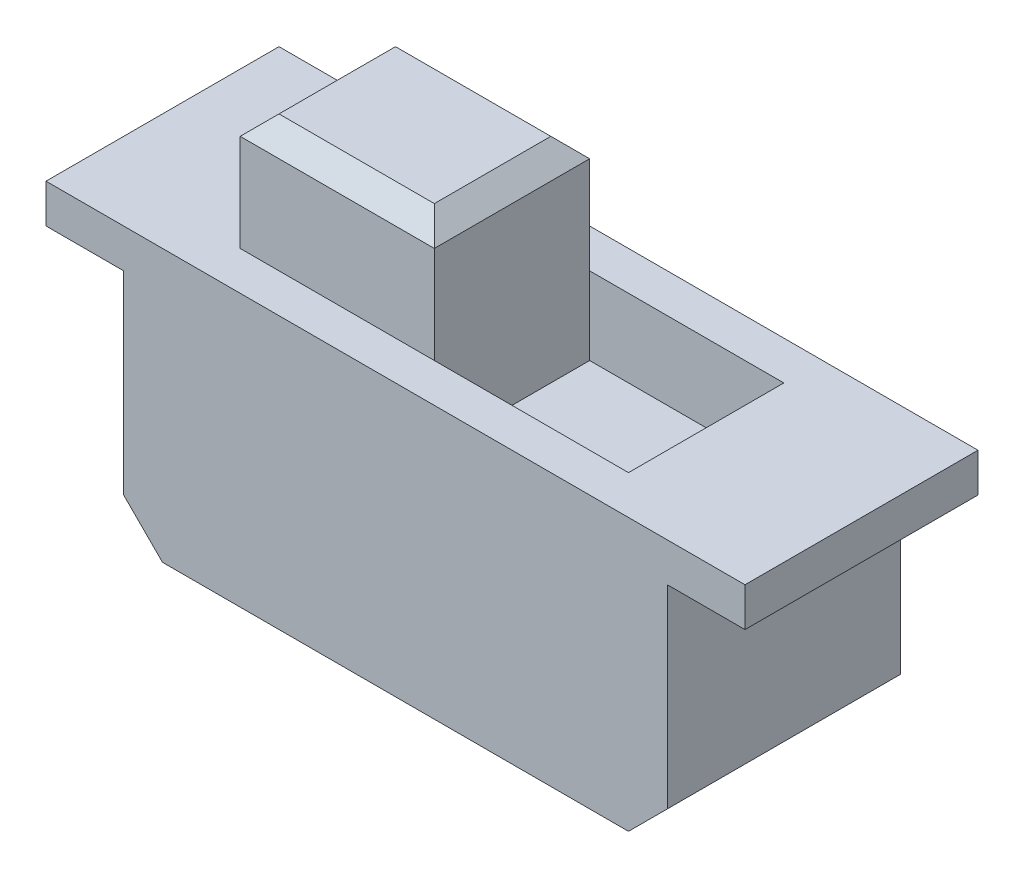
ISO-10303-21;
HEADER;
FILE_DESCRIPTION(('STEP AP214'),'2;1');
FILE_NAME('part.step','',(''),(''),'','','');
FILE_SCHEMA(('AUTOMOTIVE_DESIGN { 1 0 10303 214 1 1 1 1 }'));
ENDSEC;
DATA;
#1=APPLICATION_CONTEXT('core data for automotive mechanical design processes');
#2=APPLICATION_PROTOCOL_DEFINITION('international standard','automotive_design',2000,#1);
#3=PRODUCT_CONTEXT('',#1,'mechanical');
#4=PRODUCT('Part','Part','',(#3));
#5=PRODUCT_RELATED_PRODUCT_CATEGORY('part','',(#4));
#6=PRODUCT_DEFINITION_FORMATION('','',#4);
#7=PRODUCT_DEFINITION_CONTEXT('part definition',#1,'design');
#8=PRODUCT_DEFINITION('design','',#6,#7);
#9=PRODUCT_DEFINITION_SHAPE('','',#8);
#10=(LENGTH_UNIT() NAMED_UNIT(*) SI_UNIT(.MILLI.,.METRE.));
#11=(NAMED_UNIT(*) PLANE_ANGLE_UNIT() SI_UNIT($,.RADIAN.));
#12=(NAMED_UNIT(*) SI_UNIT($,.STERADIAN.) SOLID_ANGLE_UNIT());
#13=UNCERTAINTY_MEASURE_WITH_UNIT(LENGTH_MEASURE(1.E-05),#10,'distance_accuracy_value','');
#14=(GEOMETRIC_REPRESENTATION_CONTEXT(3) GLOBAL_UNCERTAINTY_ASSIGNED_CONTEXT((#13)) GLOBAL_UNIT_ASSIGNED_CONTEXT((#10,
#11,#12)) REPRESENTATION_CONTEXT('',''));
#15=CARTESIAN_POINT('',(0.,0.,0.));
#16=DIRECTION('',(0.,0.,1.));
#17=DIRECTION('',(1.,0.,0.));
#18=AXIS2_PLACEMENT_3D('',#15,#16,#17);
#19=CARTESIAN_POINT('',(-5.,-2.,1.));
#20=DIRECTION('',(0.,0.,-1.));
#21=DIRECTION('',(-1.,0.,0.));
#22=AXIS2_PLACEMENT_3D('',#19,#20,#21);
#23=PLANE('',#22);
#24=DIRECTION('',(0.,-1.,0.));
#25=VECTOR('',#24,1.);
#26=CARTESIAN_POINT('',(0.,3.,0.999999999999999));
#27=LINE('',#26,#25);
#28=CARTESIAN_POINT('',(0.,0.,0.999999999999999));
#29=VERTEX_POINT('',#28);
#30=CARTESIAN_POINT('',(0.,-2.,0.999999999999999));
#31=VERTEX_POINT('',#30);
#32=EDGE_CURVE('E163',#29,#31,#27,.T.);
#33=ORIENTED_EDGE('',*,*,#32,.T.);
#34=DIRECTION('',(-1.,0.,0.));
#35=VECTOR('',#34,1.);
#36=CARTESIAN_POINT('',(-5.,-2.,1.));
#37=LINE('',#36,#35);
#38=CARTESIAN_POINT('',(5.,-2.,0.999999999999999));
#39=VERTEX_POINT('',#38);
#40=EDGE_CURVE('E176',#39,#31,#37,.T.);
#41=ORIENTED_EDGE('',*,*,#40,.F.);
#42=DIRECTION('',(0.,1.,0.));
#43=VECTOR('',#42,1.);
#44=CARTESIAN_POINT('',(5.,-2.,0.999999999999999));
#45=LINE('',#44,#43);
#46=CARTESIAN_POINT('',(5.,0.,0.999999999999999));
#47=VERTEX_POINT('',#46);
#48=EDGE_CURVE('E188',#39,#47,#45,.T.);
#49=ORIENTED_EDGE('',*,*,#48,.T.);
#50=DIRECTION('',(-1.,0.,0.));
#51=VECTOR('',#50,1.);
#52=CARTESIAN_POINT('',(-5.,0.,1.));
#53=LINE('',#52,#51);
#54=EDGE_CURVE('E178',#47,#29,#53,.T.);
#55=ORIENTED_EDGE('',*,*,#54,.T.);
#56=EDGE_LOOP('',(#33,#41,#49,#55));
#57=FACE_BOUND('',#56,.T.);
#58=ADVANCED_FACE('F31',(#57),#23,.F.);
#59=CARTESIAN_POINT('',(-5.,-2.,5.));
#60=DIRECTION('',(0.,0.,1.));
#61=DIRECTION('',(1.,0.,0.));
#62=AXIS2_PLACEMENT_3D('',#59,#60,#61);
#63=PLANE('',#62);
#64=DIRECTION('',(0.,-1.,0.));
#65=VECTOR('',#64,1.);
#66=CARTESIAN_POINT('',(0.,3.,5.));
#67=LINE('',#66,#65);
#68=CARTESIAN_POINT('',(0.,0.,5.));
#69=VERTEX_POINT('',#68);
#70=CARTESIAN_POINT('',(0.,-2.,5.));
#71=VERTEX_POINT('',#70);
#72=EDGE_CURVE('E166',#69,#71,#67,.T.);
#73=ORIENTED_EDGE('',*,*,#72,.F.);
#74=DIRECTION('',(1.,0.,0.));
#75=VECTOR('',#74,1.);
#76=CARTESIAN_POINT('',(-5.,0.,5.));
#77=LINE('',#76,#75);
#78=CARTESIAN_POINT('',(5.,0.,5.));
#79=VERTEX_POINT('',#78);
#80=EDGE_CURVE('E297',#69,#79,#77,.T.);
#81=ORIENTED_EDGE('',*,*,#80,.T.);
#82=DIRECTION('',(0.,1.,0.));
#83=VECTOR('',#82,1.);
#84=CARTESIAN_POINT('',(5.,-2.,5.));
#85=LINE('',#84,#83);
#86=CARTESIAN_POINT('',(5.,-2.,5.));
#87=VERTEX_POINT('',#86);
#88=EDGE_CURVE('E185',#87,#79,#85,.T.);
#89=ORIENTED_EDGE('',*,*,#88,.F.);
#90=DIRECTION('',(1.,0.,0.));
#91=VECTOR('',#90,1.);
#92=CARTESIAN_POINT('',(-5.,-2.,5.));
#93=LINE('',#92,#91);
#94=EDGE_CURVE('E190',#71,#87,#93,.T.);
#95=ORIENTED_EDGE('',*,*,#94,.F.);
#96=EDGE_LOOP('',(#73,#81,#89,#95));
#97=FACE_BOUND('',#96,.T.);
#98=ADVANCED_FACE('F306',(#97),#63,.F.);
#99=CARTESIAN_POINT('',(-5.,-2.,5.));
#100=DIRECTION('',(0.,1.,0.));
#101=DIRECTION('',(0.,0.,1.));
#102=AXIS2_PLACEMENT_3D('',#99,#100,#101);
#103=PLANE('',#102);
#104=ORIENTED_EDGE('',*,*,#40,.T.);
#105=DIRECTION('',(0.,0.,-1.));
#106=VECTOR('',#105,1.);
#107=CARTESIAN_POINT('',(0.,-2.,5.));
#108=LINE('',#107,#106);
#109=EDGE_CURVE('E160',#71,#31,#108,.T.);
#110=ORIENTED_EDGE('',*,*,#109,.F.);
#111=ORIENTED_EDGE('',*,*,#94,.T.);
#112=DIRECTION('',(0.,0.,-1.));
#113=VECTOR('',#112,1.);
#114=CARTESIAN_POINT('',(5.,-2.,0.999999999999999));
#115=LINE('',#114,#113);
#116=EDGE_CURVE('E184',#87,#39,#115,.T.);
#117=ORIENTED_EDGE('',*,*,#116,.T.);
#118=EDGE_LOOP('',(#104,#110,#111,#117));
#119=FACE_BOUND('',#118,.T.);
#120=ADVANCED_FACE('F182',(#119),#103,.T.);
#121=CARTESIAN_POINT('',(-9.,-1.,6.));
#122=DIRECTION('',(1.,0.,0.));
#123=DIRECTION('',(0.,1.,0.));
#124=AXIS2_PLACEMENT_3D('',#121,#122,#123);
#125=PLANE('',#124);
#126=DIRECTION('',(0.,-1.,0.));
#127=VECTOR('',#126,1.);
#128=CARTESIAN_POINT('',(-9.,-1.,0.));
#129=LINE('',#128,#127);
#130=CARTESIAN_POINT('',(-9.,0.,0.));
#131=VERTEX_POINT('',#130);
#132=CARTESIAN_POINT('',(-9.,-1.,0.));
#133=VERTEX_POINT('',#132);
#134=EDGE_CURVE('E194',#131,#133,#129,.T.);
#135=ORIENTED_EDGE('',*,*,#134,.T.);
#136=DIRECTION('',(0.,0.,-1.));
#137=VECTOR('',#136,1.);
#138=CARTESIAN_POINT('',(-9.,-1.,6.));
#139=LINE('',#138,#137);
#140=CARTESIAN_POINT('',(-9.,-1.,6.));
#141=VERTEX_POINT('',#140);
#142=EDGE_CURVE('E264',#141,#133,#139,.T.);
#143=ORIENTED_EDGE('',*,*,#142,.F.);
#144=DIRECTION('',(0.,-1.,0.));
#145=VECTOR('',#144,1.);
#146=CARTESIAN_POINT('',(-9.,-1.,6.));
#147=LINE('',#146,#145);
#148=CARTESIAN_POINT('',(-9.,0.,6.));
#149=VERTEX_POINT('',#148);
#150=EDGE_CURVE('E216',#149,#141,#147,.T.);
#151=ORIENTED_EDGE('',*,*,#150,.F.);
#152=DIRECTION('',(0.,0.,-1.));
#153=VECTOR('',#152,1.);
#154=CARTESIAN_POINT('',(-9.,0.,6.));
#155=LINE('',#154,#153);
#156=EDGE_CURVE('E237',#149,#131,#155,.T.);
#157=ORIENTED_EDGE('',*,*,#156,.T.);
#158=EDGE_LOOP('',(#135,#143,#151,#157));
#159=FACE_BOUND('',#158,.T.);
#160=ADVANCED_FACE('F33',(#159),#125,.F.);
#161=CARTESIAN_POINT('',(-7.,-1.,6.));
#162=DIRECTION('',(0.,1.,0.));
#163=DIRECTION('',(-1.,0.,0.));
#164=AXIS2_PLACEMENT_3D('',#161,#162,#163);
#165=PLANE('',#164);
#166=DIRECTION('',(1.,0.,0.));
#167=VECTOR('',#166,1.);
#168=CARTESIAN_POINT('',(-7.,-1.,0.));
#169=LINE('',#168,#167);
#170=CARTESIAN_POINT('',(-7.,-1.,0.));
#171=VERTEX_POINT('',#170);
#172=EDGE_CURVE('E198',#133,#171,#169,.T.);
#173=ORIENTED_EDGE('',*,*,#172,.T.);
#174=DIRECTION('',(0.,0.,-1.));
#175=VECTOR('',#174,1.);
#176=CARTESIAN_POINT('',(-7.,-1.,6.));
#177=LINE('',#176,#175);
#178=CARTESIAN_POINT('',(-7.,-1.,6.));
#179=VERTEX_POINT('',#178);
#180=EDGE_CURVE('E261',#179,#171,#177,.T.);
#181=ORIENTED_EDGE('',*,*,#180,.F.);
#182=DIRECTION('',(1.,0.,0.));
#183=VECTOR('',#182,1.);
#184=CARTESIAN_POINT('',(-7.,-1.,6.));
#185=LINE('',#184,#183);
#186=EDGE_CURVE('E219',#141,#179,#185,.T.);
#187=ORIENTED_EDGE('',*,*,#186,.F.);
#188=ORIENTED_EDGE('',*,*,#142,.T.);
#189=EDGE_LOOP('',(#173,#181,#187,#188));
#190=FACE_BOUND('',#189,.T.);
#191=ADVANCED_FACE('F397',(#190),#165,.F.);
#192=CARTESIAN_POINT('',(-7.,-6.,6.));
#193=DIRECTION('',(1.,0.,0.));
#194=DIRECTION('',(0.,1.,0.));
#195=AXIS2_PLACEMENT_3D('',#192,#193,#194);
#196=PLANE('',#195);
#197=DIRECTION('',(0.,-1.,0.));
#198=VECTOR('',#197,1.);
#199=CARTESIAN_POINT('',(-7.,-6.,0.));
#200=LINE('',#199,#198);
#201=CARTESIAN_POINT('',(-7.,-6.,0.));
#202=VERTEX_POINT('',#201);
#203=EDGE_CURVE('E200',#171,#202,#200,.T.);
#204=ORIENTED_EDGE('',*,*,#203,.T.);
#205=DIRECTION('',(0.,0.,-1.));
#206=VECTOR('',#205,1.);
#207=CARTESIAN_POINT('',(-7.,-6.,6.));
#208=LINE('',#207,#206);
#209=CARTESIAN_POINT('',(-7.,-6.,6.));
#210=VERTEX_POINT('',#209);
#211=EDGE_CURVE('E258',#210,#202,#208,.T.);
#212=ORIENTED_EDGE('',*,*,#211,.F.);
#213=DIRECTION('',(0.,-1.,0.));
#214=VECTOR('',#213,1.);
#215=CARTESIAN_POINT('',(-7.,-6.,6.));
#216=LINE('',#215,#214);
#217=EDGE_CURVE('E221',#179,#210,#216,.T.);
#218=ORIENTED_EDGE('',*,*,#217,.F.);
#219=ORIENTED_EDGE('',*,*,#180,.T.);
#220=EDGE_LOOP('',(#204,#212,#218,#219));
#221=FACE_BOUND('',#220,.T.);
#222=ADVANCED_FACE('F394',(#221),#196,.F.);
#223=CARTESIAN_POINT('',(-6.,-7.,6.));
#224=DIRECTION('',(0.707106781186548,0.707106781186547,0.));
#225=DIRECTION('',(-0.707106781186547,0.707106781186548,0.));
#226=AXIS2_PLACEMENT_3D('',#223,#224,#225);
#227=PLANE('',#226);
#228=DIRECTION('',(0.707106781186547,-0.707106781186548,0.));
#229=VECTOR('',#228,1.);
#230=CARTESIAN_POINT('',(-6.,-7.,0.));
#231=LINE('',#230,#229);
#232=CARTESIAN_POINT('',(-6.,-7.,0.));
#233=VERTEX_POINT('',#232);
#234=EDGE_CURVE('E202',#202,#233,#231,.T.);
#235=ORIENTED_EDGE('',*,*,#234,.T.);
#236=DIRECTION('',(0.,0.,-1.));
#237=VECTOR('',#236,1.);
#238=CARTESIAN_POINT('',(-6.,-7.,6.));
#239=LINE('',#238,#237);
#240=CARTESIAN_POINT('',(-6.,-7.,6.));
#241=VERTEX_POINT('',#240);
#242=EDGE_CURVE('E255',#241,#233,#239,.T.);
#243=ORIENTED_EDGE('',*,*,#242,.F.);
#244=DIRECTION('',(0.707106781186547,-0.707106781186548,0.));
#245=VECTOR('',#244,1.);
#246=CARTESIAN_POINT('',(-6.,-7.,6.));
#247=LINE('',#246,#245);
#248=EDGE_CURVE('E223',#210,#241,#247,.T.);
#249=ORIENTED_EDGE('',*,*,#248,.F.);
#250=ORIENTED_EDGE('',*,*,#211,.T.);
#251=EDGE_LOOP('',(#235,#243,#249,#250));
#252=FACE_BOUND('',#251,.T.);
#253=ADVANCED_FACE('F390',(#252),#227,.F.);
#254=CARTESIAN_POINT('',(6.,-7.,6.));
#255=DIRECTION('',(0.,1.,0.));
#256=DIRECTION('',(0.,0.,1.));
#257=AXIS2_PLACEMENT_3D('',#254,#255,#256);
#258=PLANE('',#257);
#259=DIRECTION('',(1.,0.,0.));
#260=VECTOR('',#259,1.);
#261=CARTESIAN_POINT('',(6.,-7.,0.));
#262=LINE('',#261,#260);
#263=CARTESIAN_POINT('',(6.,-7.,0.));
#264=VERTEX_POINT('',#263);
#265=EDGE_CURVE('E204',#233,#264,#262,.T.);
#266=ORIENTED_EDGE('',*,*,#265,.T.);
#267=DIRECTION('',(0.,0.,-1.));
#268=VECTOR('',#267,1.);
#269=CARTESIAN_POINT('',(6.,-7.,6.));
#270=LINE('',#269,#268);
#271=CARTESIAN_POINT('',(6.,-7.,6.));
#272=VERTEX_POINT('',#271);
#273=EDGE_CURVE('E252',#272,#264,#270,.T.);
#274=ORIENTED_EDGE('',*,*,#273,.F.);
#275=DIRECTION('',(1.,0.,0.));
#276=VECTOR('',#275,1.);
#277=CARTESIAN_POINT('',(6.,-7.,6.));
#278=LINE('',#277,#276);
#279=EDGE_CURVE('E225',#241,#272,#278,.T.);
#280=ORIENTED_EDGE('',*,*,#279,.F.);
#281=ORIENTED_EDGE('',*,*,#242,.T.);
#282=EDGE_LOOP('',(#266,#274,#280,#281));
#283=FACE_BOUND('',#282,.T.);
#284=ADVANCED_FACE('F386',(#283),#258,.F.);
#285=CARTESIAN_POINT('',(7.,-6.,6.));
#286=DIRECTION('',(-0.707106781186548,0.707106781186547,0.));
#287=DIRECTION('',(-0.707106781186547,-0.707106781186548,0.));
#288=AXIS2_PLACEMENT_3D('',#285,#286,#287);
#289=PLANE('',#288);
#290=DIRECTION('',(0.707106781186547,0.707106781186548,0.));
#291=VECTOR('',#290,1.);
#292=CARTESIAN_POINT('',(7.,-6.,0.));
#293=LINE('',#292,#291);
#294=CARTESIAN_POINT('',(7.,-6.,0.));
#295=VERTEX_POINT('',#294);
#296=EDGE_CURVE('E206',#264,#295,#293,.T.);
#297=ORIENTED_EDGE('',*,*,#296,.T.);
#298=DIRECTION('',(0.,0.,-1.));
#299=VECTOR('',#298,1.);
#300=CARTESIAN_POINT('',(7.,-6.,6.));
#301=LINE('',#300,#299);
#302=CARTESIAN_POINT('',(7.,-6.,6.));
#303=VERTEX_POINT('',#302);
#304=EDGE_CURVE('E249',#303,#295,#301,.T.);
#305=ORIENTED_EDGE('',*,*,#304,.F.);
#306=DIRECTION('',(0.707106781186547,0.707106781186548,0.));
#307=VECTOR('',#306,1.);
#308=CARTESIAN_POINT('',(7.,-6.,6.));
#309=LINE('',#308,#307);
#310=EDGE_CURVE('E227',#272,#303,#309,.T.);
#311=ORIENTED_EDGE('',*,*,#310,.F.);
#312=ORIENTED_EDGE('',*,*,#273,.T.);
#313=EDGE_LOOP('',(#297,#305,#311,#312));
#314=FACE_BOUND('',#313,.T.);
#315=ADVANCED_FACE('F382',(#314),#289,.F.);
#316=CARTESIAN_POINT('',(7.,-1.,6.));
#317=DIRECTION('',(-1.,0.,0.));
#318=DIRECTION('',(0.,-1.,0.));
#319=AXIS2_PLACEMENT_3D('',#316,#317,#318);
#320=PLANE('',#319);
#321=DIRECTION('',(0.,1.,0.));
#322=VECTOR('',#321,1.);
#323=CARTESIAN_POINT('',(7.,-1.,0.));
#324=LINE('',#323,#322);
#325=CARTESIAN_POINT('',(7.,-1.,0.));
#326=VERTEX_POINT('',#325);
#327=EDGE_CURVE('E208',#295,#326,#324,.T.);
#328=ORIENTED_EDGE('',*,*,#327,.T.);
#329=DIRECTION('',(0.,0.,-1.));
#330=VECTOR('',#329,1.);
#331=CARTESIAN_POINT('',(7.,-1.,6.));
#332=LINE('',#331,#330);
#333=CARTESIAN_POINT('',(7.,-1.,6.));
#334=VERTEX_POINT('',#333);
#335=EDGE_CURVE('E246',#334,#326,#332,.T.);
#336=ORIENTED_EDGE('',*,*,#335,.F.);
#337=DIRECTION('',(0.,1.,0.));
#338=VECTOR('',#337,1.);
#339=CARTESIAN_POINT('',(7.,-1.,6.));
#340=LINE('',#339,#338);
#341=EDGE_CURVE('E229',#303,#334,#340,.T.);
#342=ORIENTED_EDGE('',*,*,#341,.F.);
#343=ORIENTED_EDGE('',*,*,#304,.T.);
#344=EDGE_LOOP('',(#328,#336,#342,#343));
#345=FACE_BOUND('',#344,.T.);
#346=ADVANCED_FACE('F378',(#345),#320,.F.);
#347=CARTESIAN_POINT('',(9.,-1.,6.));
#348=DIRECTION('',(0.,1.,0.));
#349=DIRECTION('',(-1.,0.,0.));
#350=AXIS2_PLACEMENT_3D('',#347,#348,#349);
#351=PLANE('',#350);
#352=DIRECTION('',(1.,0.,0.));
#353=VECTOR('',#352,1.);
#354=CARTESIAN_POINT('',(9.,-1.,0.));
#355=LINE('',#354,#353);
#356=CARTESIAN_POINT('',(9.,-1.,0.));
#357=VERTEX_POINT('',#356);
#358=EDGE_CURVE('E210',#326,#357,#355,.T.);
#359=ORIENTED_EDGE('',*,*,#358,.T.);
#360=DIRECTION('',(0.,0.,-1.));
#361=VECTOR('',#360,1.);
#362=CARTESIAN_POINT('',(9.,-1.,6.));
#363=LINE('',#362,#361);
#364=CARTESIAN_POINT('',(9.,-1.,6.));
#365=VERTEX_POINT('',#364);
#366=EDGE_CURVE('E243',#365,#357,#363,.T.);
#367=ORIENTED_EDGE('',*,*,#366,.F.);
#368=DIRECTION('',(1.,0.,0.));
#369=VECTOR('',#368,1.);
#370=CARTESIAN_POINT('',(9.,-1.,6.));
#371=LINE('',#370,#369);
#372=EDGE_CURVE('E231',#334,#365,#371,.T.);
#373=ORIENTED_EDGE('',*,*,#372,.F.);
#374=ORIENTED_EDGE('',*,*,#335,.T.);
#375=EDGE_LOOP('',(#359,#367,#373,#374));
#376=FACE_BOUND('',#375,.T.);
#377=ADVANCED_FACE('F374',(#376),#351,.F.);
#378=CARTESIAN_POINT('',(9.,0.,6.));
#379=DIRECTION('',(-1.,0.,0.));
#380=DIRECTION('',(0.,-1.,0.));
#381=AXIS2_PLACEMENT_3D('',#378,#379,#380);
#382=PLANE('',#381);
#383=DIRECTION('',(0.,1.,0.));
#384=VECTOR('',#383,1.);
#385=CARTESIAN_POINT('',(9.,0.,0.));
#386=LINE('',#385,#384);
#387=CARTESIAN_POINT('',(9.,0.,0.));
#388=VERTEX_POINT('',#387);
#389=EDGE_CURVE('E212',#357,#388,#386,.T.);
#390=ORIENTED_EDGE('',*,*,#389,.T.);
#391=DIRECTION('',(0.,0.,-1.));
#392=VECTOR('',#391,1.);
#393=CARTESIAN_POINT('',(9.,0.,6.));
#394=LINE('',#393,#392);
#395=CARTESIAN_POINT('',(9.,0.,6.));
#396=VERTEX_POINT('',#395);
#397=EDGE_CURVE('E240',#396,#388,#394,.T.);
#398=ORIENTED_EDGE('',*,*,#397,.F.);
#399=DIRECTION('',(0.,1.,0.));
#400=VECTOR('',#399,1.);
#401=CARTESIAN_POINT('',(9.,0.,6.));
#402=LINE('',#401,#400);
#403=EDGE_CURVE('E233',#365,#396,#402,.T.);
#404=ORIENTED_EDGE('',*,*,#403,.F.);
#405=ORIENTED_EDGE('',*,*,#366,.T.);
#406=EDGE_LOOP('',(#390,#398,#404,#405));
#407=FACE_BOUND('',#406,.T.);
#408=ADVANCED_FACE('F371',(#407),#382,.F.);
#409=CARTESIAN_POINT('',(-9.,0.,6.));
#410=DIRECTION('',(0.,-1.,0.));
#411=DIRECTION('',(0.,0.,-1.));
#412=AXIS2_PLACEMENT_3D('',#409,#410,#411);
#413=PLANE('',#412);
#414=CARTESIAN_POINT('',(-5.,0.,5.));
#415=VERTEX_POINT('',#414);
#416=EDGE_CURVE('E298',#415,#69,#77,.T.);
#417=ORIENTED_EDGE('',*,*,#416,.F.);
#418=DIRECTION('',(0.,0.,1.));
#419=VECTOR('',#418,1.);
#420=CARTESIAN_POINT('',(-5.,0.,1.));
#421=LINE('',#420,#419);
#422=CARTESIAN_POINT('',(-5.,0.,0.999999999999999));
#423=VERTEX_POINT('',#422);
#424=EDGE_CURVE('E294',#423,#415,#421,.T.);
#425=ORIENTED_EDGE('',*,*,#424,.F.);
#426=DIRECTION('',(-1.,0.,0.));
#427=VECTOR('',#426,1.);
#428=CARTESIAN_POINT('',(-9.,0.,1.));
#429=LINE('',#428,#427);
#430=EDGE_CURVE('E292',#29,#423,#429,.T.);
#431=ORIENTED_EDGE('',*,*,#430,.F.);
#432=ORIENTED_EDGE('',*,*,#54,.F.);
#433=DIRECTION('',(0.,0.,-1.));
#434=VECTOR('',#433,1.);
#435=CARTESIAN_POINT('',(5.,0.,0.999999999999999));
#436=LINE('',#435,#434);
#437=EDGE_CURVE('E301',#79,#47,#436,.T.);
#438=ORIENTED_EDGE('',*,*,#437,.F.);
#439=ORIENTED_EDGE('',*,*,#80,.F.);
#440=EDGE_LOOP('',(#417,#425,#431,#432,#438,#439));
#441=FACE_BOUND('',#440,.T.);
#442=DIRECTION('',(-1.,0.,0.));
#443=VECTOR('',#442,1.);
#444=CARTESIAN_POINT('',(-9.,0.,0.));
#445=LINE('',#444,#443);
#446=EDGE_CURVE('E214',#388,#131,#445,.T.);
#447=ORIENTED_EDGE('',*,*,#446,.T.);
#448=ORIENTED_EDGE('',*,*,#156,.F.);
#449=DIRECTION('',(-1.,0.,0.));
#450=VECTOR('',#449,1.);
#451=CARTESIAN_POINT('',(-9.,0.,6.));
#452=LINE('',#451,#450);
#453=EDGE_CURVE('E235',#396,#149,#452,.T.);
#454=ORIENTED_EDGE('',*,*,#453,.F.);
#455=ORIENTED_EDGE('',*,*,#397,.T.);
#456=EDGE_LOOP('',(#447,#448,#454,#455));
#457=FACE_BOUND('',#456,.T.);
#458=ADVANCED_FACE('F313',(#441,#457),#413,.F.);
#459=CARTESIAN_POINT('',(-9.,-0.999999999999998,6.));
#460=DIRECTION('',(0.,0.,1.));
#461=DIRECTION('',(1.,0.,0.));
#462=AXIS2_PLACEMENT_3D('',#459,#460,#461);
#463=PLANE('',#462);
#464=ORIENTED_EDGE('',*,*,#150,.T.);
#465=ORIENTED_EDGE('',*,*,#186,.T.);
#466=ORIENTED_EDGE('',*,*,#217,.T.);
#467=ORIENTED_EDGE('',*,*,#248,.T.);
#468=ORIENTED_EDGE('',*,*,#279,.T.);
#469=ORIENTED_EDGE('',*,*,#310,.T.);
#470=ORIENTED_EDGE('',*,*,#341,.T.);
#471=ORIENTED_EDGE('',*,*,#372,.T.);
#472=ORIENTED_EDGE('',*,*,#403,.T.);
#473=ORIENTED_EDGE('',*,*,#453,.T.);
#474=EDGE_LOOP('',(#464,#465,#466,#467,#468,#469,#470,#471,#472,#473));
#475=FACE_BOUND('',#474,.T.);
#476=ADVANCED_FACE('F364',(#475),#463,.T.);
#477=CARTESIAN_POINT('',(-9.,-0.999999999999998,0.));
#478=DIRECTION('',(0.,0.,1.));
#479=DIRECTION('',(1.,0.,0.));
#480=AXIS2_PLACEMENT_3D('',#477,#478,#479);
#481=PLANE('',#480);
#482=ORIENTED_EDGE('',*,*,#134,.F.);
#483=ORIENTED_EDGE('',*,*,#446,.F.);
#484=ORIENTED_EDGE('',*,*,#389,.F.);
#485=ORIENTED_EDGE('',*,*,#358,.F.);
#486=ORIENTED_EDGE('',*,*,#327,.F.);
#487=ORIENTED_EDGE('',*,*,#296,.F.);
#488=ORIENTED_EDGE('',*,*,#265,.F.);
#489=ORIENTED_EDGE('',*,*,#234,.F.);
#490=ORIENTED_EDGE('',*,*,#203,.F.);
#491=ORIENTED_EDGE('',*,*,#172,.F.);
#492=EDGE_LOOP('',(#482,#483,#484,#485,#486,#487,#488,#489,#490,#491));
#493=FACE_BOUND('',#492,.T.);
#494=ADVANCED_FACE('F360',(#493),#481,.F.);
#495=CARTESIAN_POINT('',(5.,-2.,0.999999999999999));
#496=DIRECTION('',(1.,0.,0.));
#497=DIRECTION('',(0.,0.,-1.));
#498=AXIS2_PLACEMENT_3D('',#495,#496,#497);
#499=PLANE('',#498);
#500=ORIENTED_EDGE('',*,*,#437,.T.);
#501=ORIENTED_EDGE('',*,*,#48,.F.);
#502=ORIENTED_EDGE('',*,*,#116,.F.);
#503=ORIENTED_EDGE('',*,*,#88,.T.);
#504=EDGE_LOOP('',(#500,#501,#502,#503));
#505=FACE_BOUND('',#504,.T.);
#506=ADVANCED_FACE('F310',(#505),#499,.F.);
#507=CARTESIAN_POINT('',(-5.,3.,5.));
#508=DIRECTION('',(1.,0.,0.));
#509=DIRECTION('',(0.,0.,-1.));
#510=AXIS2_PLACEMENT_3D('',#507,#508,#509);
#511=PLANE('',#510);
#512=DIRECTION('',(0.,-1.,0.));
#513=VECTOR('',#512,1.);
#514=CARTESIAN_POINT('',(-5.,3.,5.));
#515=LINE('',#514,#513);
#516=CARTESIAN_POINT('',(-5.,2.5,5.));
#517=VERTEX_POINT('',#516);
#518=EDGE_CURVE('E290',#517,#415,#515,.T.);
#519=ORIENTED_EDGE('',*,*,#518,.F.);
#520=DIRECTION('',(0.,0.,-1.));
#521=VECTOR('',#520,1.);
#522=CARTESIAN_POINT('',(-5.,2.5,5.));
#523=LINE('',#522,#521);
#524=CARTESIAN_POINT('',(-5.,2.5,0.999999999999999));
#525=VERTEX_POINT('',#524);
#526=EDGE_CURVE('E11',#517,#525,#523,.T.);
#527=ORIENTED_EDGE('',*,*,#526,.T.);
#528=DIRECTION('',(0.,-1.,0.));
#529=VECTOR('',#528,1.);
#530=CARTESIAN_POINT('',(-5.,3.,0.999999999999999));
#531=LINE('',#530,#529);
#532=EDGE_CURVE('E170',#525,#423,#531,.T.);
#533=ORIENTED_EDGE('',*,*,#532,.T.);
#534=ORIENTED_EDGE('',*,*,#424,.T.);
#535=EDGE_LOOP('',(#519,#527,#533,#534));
#536=FACE_BOUND('',#535,.T.);
#537=ADVANCED_FACE('F317',(#536),#511,.F.);
#538=CARTESIAN_POINT('',(-5.,3.,5.));
#539=DIRECTION('',(0.,0.,-1.));
#540=DIRECTION('',(-1.,0.,0.));
#541=AXIS2_PLACEMENT_3D('',#538,#539,#540);
#542=PLANE('',#541);
#543=CARTESIAN_POINT('',(0.,2.5,5.));
#544=VERTEX_POINT('',#543);
#545=EDGE_CURVE('E286',#544,#69,#67,.T.);
#546=ORIENTED_EDGE('',*,*,#545,.F.);
#547=DIRECTION('',(-1.,0.,0.));
#548=VECTOR('',#547,1.);
#549=CARTESIAN_POINT('',(-5.,2.5,5.));
#550=LINE('',#549,#548);
#551=EDGE_CURVE('E39',#544,#517,#550,.T.);
#552=ORIENTED_EDGE('',*,*,#551,.T.);
#553=ORIENTED_EDGE('',*,*,#518,.T.);
#554=ORIENTED_EDGE('',*,*,#416,.T.);
#555=EDGE_LOOP('',(#546,#552,#553,#554));
#556=FACE_BOUND('',#555,.T.);
#557=ADVANCED_FACE('F529',(#556),#542,.F.);
#558=CARTESIAN_POINT('',(-5.,3.,0.999999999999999));
#559=DIRECTION('',(0.,0.,1.));
#560=DIRECTION('',(1.,0.,0.));
#561=AXIS2_PLACEMENT_3D('',#558,#559,#560);
#562=PLANE('',#561);
#563=ORIENTED_EDGE('',*,*,#532,.F.);
#564=DIRECTION('',(1.,0.,0.));
#565=VECTOR('',#564,1.);
#566=CARTESIAN_POINT('',(-5.,2.5,0.999999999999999));
#567=LINE('',#566,#565);
#568=CARTESIAN_POINT('',(0.,2.5,0.999999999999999));
#569=VERTEX_POINT('',#568);
#570=EDGE_CURVE('E276',#525,#569,#567,.T.);
#571=ORIENTED_EDGE('',*,*,#570,.T.);
#572=EDGE_CURVE('E179',#569,#29,#27,.T.);
#573=ORIENTED_EDGE('',*,*,#572,.T.);
#574=ORIENTED_EDGE('',*,*,#430,.T.);
#575=EDGE_LOOP('',(#563,#571,#573,#574));
#576=FACE_BOUND('',#575,.T.);
#577=ADVANCED_FACE('F282',(#576),#562,.F.);
#578=CARTESIAN_POINT('',(0.,3.,5.));
#579=DIRECTION('',(-1.,0.,0.));
#580=DIRECTION('',(0.,0.,1.));
#581=AXIS2_PLACEMENT_3D('',#578,#579,#580);
#582=PLANE('',#581);
#583=ORIENTED_EDGE('',*,*,#572,.F.);
#584=DIRECTION('',(0.,0.,1.));
#585=VECTOR('',#584,1.);
#586=CARTESIAN_POINT('',(0.,2.5,5.));
#587=LINE('',#586,#585);
#588=EDGE_CURVE('E53',#569,#544,#587,.T.);
#589=ORIENTED_EDGE('',*,*,#588,.T.);
#590=ORIENTED_EDGE('',*,*,#545,.T.);
#591=ORIENTED_EDGE('',*,*,#72,.T.);
#592=ORIENTED_EDGE('',*,*,#109,.T.);
#593=ORIENTED_EDGE('',*,*,#32,.F.);
#594=EDGE_LOOP('',(#583,#589,#590,#591,#592,#593));
#595=FACE_BOUND('',#594,.T.);
#596=ADVANCED_FACE('F162',(#595),#582,.F.);
#597=CARTESIAN_POINT('',(-5.,3.,5.));
#598=DIRECTION('',(0.,-1.,0.));
#599=DIRECTION('',(0.,0.,-1.));
#600=AXIS2_PLACEMENT_3D('',#597,#598,#599);
#601=PLANE('',#600);
#602=DIRECTION('',(0.,0.,-1.));
#603=VECTOR('',#602,1.);
#604=CARTESIAN_POINT('',(-0.5,3.,5.));
#605=LINE('',#604,#603);
#606=CARTESIAN_POINT('',(-0.500000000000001,3.,4.5));
#607=VERTEX_POINT('',#606);
#608=CARTESIAN_POINT('',(-0.500000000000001,3.,1.5));
#609=VERTEX_POINT('',#608);
#610=EDGE_CURVE('E271',#607,#609,#605,.T.);
#611=ORIENTED_EDGE('',*,*,#610,.T.);
#612=DIRECTION('',(-1.,0.,0.));
#613=VECTOR('',#612,1.);
#614=CARTESIAN_POINT('',(-5.,3.,1.5));
#615=LINE('',#614,#613);
#616=CARTESIAN_POINT('',(-4.5,3.,1.5));
#617=VERTEX_POINT('',#616);
#618=EDGE_CURVE('E273',#609,#617,#615,.T.);
#619=ORIENTED_EDGE('',*,*,#618,.T.);
#620=DIRECTION('',(0.,0.,1.));
#621=VECTOR('',#620,1.);
#622=CARTESIAN_POINT('',(-4.5,3.,5.));
#623=LINE('',#622,#621);
#624=CARTESIAN_POINT('',(-4.5,3.,4.5));
#625=VERTEX_POINT('',#624);
#626=EDGE_CURVE('E267',#617,#625,#623,.T.);
#627=ORIENTED_EDGE('',*,*,#626,.T.);
#628=DIRECTION('',(1.,0.,0.));
#629=VECTOR('',#628,1.);
#630=CARTESIAN_POINT('',(-5.,3.,4.5));
#631=LINE('',#630,#629);
#632=EDGE_CURVE('E269',#625,#607,#631,.T.);
#633=ORIENTED_EDGE('',*,*,#632,.T.);
#634=EDGE_LOOP('',(#611,#619,#627,#633));
#635=FACE_BOUND('',#634,.T.);
#636=ADVANCED_FACE('F342',(#635),#601,.F.);
#637=CARTESIAN_POINT('',(-5.,3.,4.5));
#638=DIRECTION('',(0.,-0.707106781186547,-0.707106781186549));
#639=DIRECTION('',(0.,0.707106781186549,-0.707106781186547));
#640=AXIS2_PLACEMENT_3D('',#637,#638,#639);
#641=PLANE('',#640);
#642=DIRECTION('',(0.577350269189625,0.577350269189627,-0.577350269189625));
#643=VECTOR('',#642,1.);
#644=CARTESIAN_POINT('',(-4.66666666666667,2.83333333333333,4.66666666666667));
#645=LINE('',#644,#643);
#646=EDGE_CURVE('E324',#517,#625,#645,.T.);
#647=ORIENTED_EDGE('',*,*,#646,.F.);
#648=ORIENTED_EDGE('',*,*,#551,.F.);
#649=DIRECTION('',(-0.577350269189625,0.577350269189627,-0.577350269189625));
#650=VECTOR('',#649,1.);
#651=CARTESIAN_POINT('',(-2.,4.5,3.));
#652=LINE('',#651,#650);
#653=EDGE_CURVE('E171',#607,#544,#652,.F.);
#654=ORIENTED_EDGE('',*,*,#653,.F.);
#655=ORIENTED_EDGE('',*,*,#632,.F.);
#656=EDGE_LOOP('',(#647,#648,#654,#655));
#657=FACE_BOUND('',#656,.T.);
#658=ADVANCED_FACE('F340',(#657),#641,.F.);
#659=CARTESIAN_POINT('',(-0.5,3.,5.));
#660=DIRECTION('',(-0.707106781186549,-0.707106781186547,0.));
#661=DIRECTION('',(0.707106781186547,-0.707106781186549,0.));
#662=AXIS2_PLACEMENT_3D('',#659,#660,#661);
#663=PLANE('',#662);
#664=ORIENTED_EDGE('',*,*,#653,.T.);
#665=ORIENTED_EDGE('',*,*,#588,.F.);
#666=DIRECTION('',(-0.577350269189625,0.577350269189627,0.577350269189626));
#667=VECTOR('',#666,1.);
#668=CARTESIAN_POINT('',(-1.66666666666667,4.16666666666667,2.66666666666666));
#669=LINE('',#668,#667);
#670=EDGE_CURVE('E327',#609,#569,#669,.F.);
#671=ORIENTED_EDGE('',*,*,#670,.F.);
#672=ORIENTED_EDGE('',*,*,#610,.F.);
#673=EDGE_LOOP('',(#664,#665,#671,#672));
#674=FACE_BOUND('',#673,.T.);
#675=ADVANCED_FACE('F336',(#674),#663,.F.);
#676=CARTESIAN_POINT('',(-4.5,3.,5.));
#677=DIRECTION('',(0.707106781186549,-0.707106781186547,0.));
#678=DIRECTION('',(0.707106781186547,0.707106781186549,0.));
#679=AXIS2_PLACEMENT_3D('',#676,#677,#678);
#680=PLANE('',#679);
#681=ORIENTED_EDGE('',*,*,#646,.T.);
#682=ORIENTED_EDGE('',*,*,#626,.F.);
#683=DIRECTION('',(-0.577350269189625,-0.577350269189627,-0.577350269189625));
#684=VECTOR('',#683,1.);
#685=CARTESIAN_POINT('',(-3.33333333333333,4.16666666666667,2.66666666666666));
#686=LINE('',#685,#684);
#687=EDGE_CURVE('E325',#525,#617,#686,.F.);
#688=ORIENTED_EDGE('',*,*,#687,.F.);
#689=ORIENTED_EDGE('',*,*,#526,.F.);
#690=EDGE_LOOP('',(#681,#682,#688,#689));
#691=FACE_BOUND('',#690,.T.);
#692=ADVANCED_FACE('F322',(#691),#680,.F.);
#693=CARTESIAN_POINT('',(-5.,3.,1.5));
#694=DIRECTION('',(0.,-0.707106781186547,0.707106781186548));
#695=DIRECTION('',(0.,-0.707106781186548,-0.707106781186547));
#696=AXIS2_PLACEMENT_3D('',#693,#694,#695);
#697=PLANE('',#696);
#698=ORIENTED_EDGE('',*,*,#670,.T.);
#699=ORIENTED_EDGE('',*,*,#570,.F.);
#700=ORIENTED_EDGE('',*,*,#687,.T.);
#701=ORIENTED_EDGE('',*,*,#618,.F.);
#702=EDGE_LOOP('',(#698,#699,#700,#701));
#703=FACE_BOUND('',#702,.T.);
#704=ADVANCED_FACE('F343',(#703),#697,.F.);
#705=CLOSED_SHELL('',(#58,#98,#120,#160,#191,#222,#253,#284,#315,#346,#377,#408,#458,#476,#494,
#506,#537,#557,#577,#596,#636,#658,#675,#692,#704));
#706=MANIFOLD_SOLID_BREP('B2',#705);
#707=ADVANCED_BREP_SHAPE_REPRESENTATION('',(#18,#706),#14);
#708=SHAPE_DEFINITION_REPRESENTATION(#9,#707);
ENDSEC;
END-ISO-10303-21;
